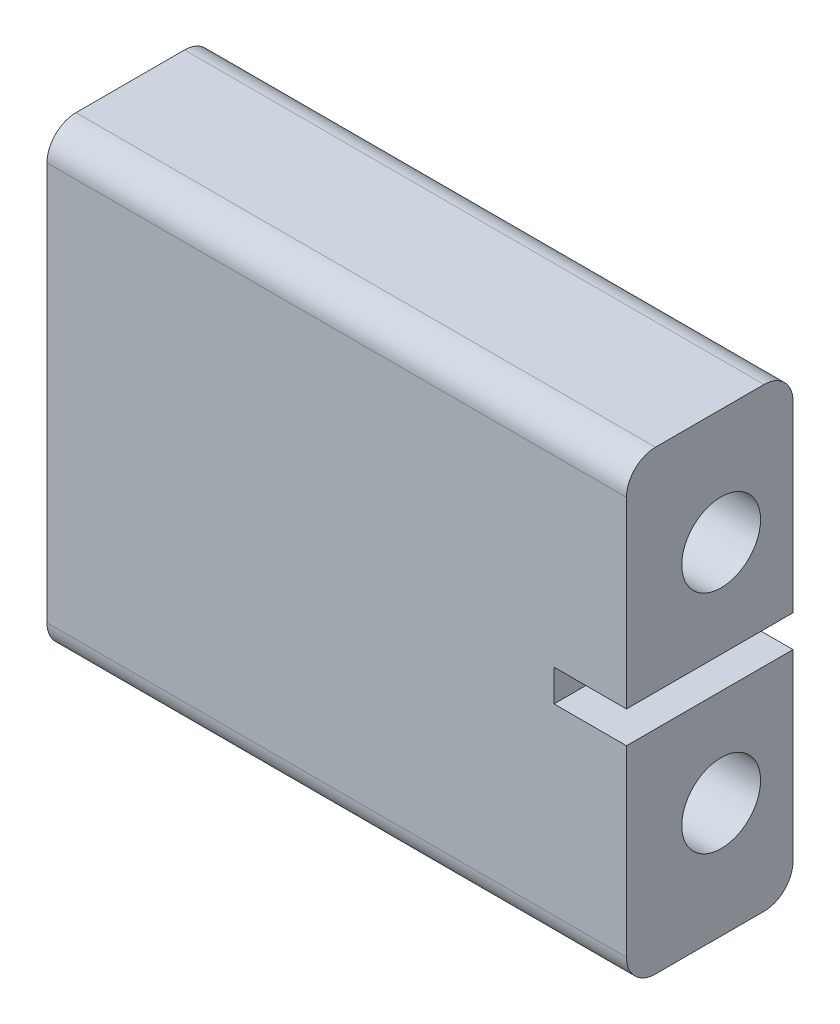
ISO-10303-21;
HEADER;
FILE_DESCRIPTION(('STEP AP214'),'2;1');
FILE_NAME('part.step','',(''),(''),'','','');
FILE_SCHEMA(('AUTOMOTIVE_DESIGN { 1 0 10303 214 1 1 1 1 }'));
ENDSEC;
DATA;
#1=APPLICATION_CONTEXT('core data for automotive mechanical design processes');
#2=APPLICATION_PROTOCOL_DEFINITION('international standard','automotive_design',2000,#1);
#3=PRODUCT_CONTEXT('',#1,'mechanical');
#4=PRODUCT('Part','Part','',(#3));
#5=PRODUCT_RELATED_PRODUCT_CATEGORY('part','',(#4));
#6=PRODUCT_DEFINITION_FORMATION('','',#4);
#7=PRODUCT_DEFINITION_CONTEXT('part definition',#1,'design');
#8=PRODUCT_DEFINITION('design','',#6,#7);
#9=PRODUCT_DEFINITION_SHAPE('','',#8);
#10=(LENGTH_UNIT() NAMED_UNIT(*) SI_UNIT(.MILLI.,.METRE.));
#11=(NAMED_UNIT(*) PLANE_ANGLE_UNIT() SI_UNIT($,.RADIAN.));
#12=(NAMED_UNIT(*) SI_UNIT($,.STERADIAN.) SOLID_ANGLE_UNIT());
#13=UNCERTAINTY_MEASURE_WITH_UNIT(LENGTH_MEASURE(1.E-05),#10,'distance_accuracy_value','');
#14=(GEOMETRIC_REPRESENTATION_CONTEXT(3) GLOBAL_UNCERTAINTY_ASSIGNED_CONTEXT((#13)) GLOBAL_UNIT_ASSIGNED_CONTEXT((#10,
#11,#12)) REPRESENTATION_CONTEXT('',''));
#15=CARTESIAN_POINT('',(0.,0.,0.));
#16=DIRECTION('',(0.,0.,1.));
#17=DIRECTION('',(1.,0.,0.));
#18=AXIS2_PLACEMENT_3D('',#15,#16,#17);
#19=CARTESIAN_POINT('',(25.4,0.,0.));
#20=DIRECTION('',(-1.,0.,0.));
#21=DIRECTION('',(0.,0.,1.));
#22=AXIS2_PLACEMENT_3D('',#19,#20,#21);
#23=PLANE('',#22);
#24=CARTESIAN_POINT('',(25.4,16.5889967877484,-23.594));
#25=DIRECTION('',(1.,0.,0.));
#26=DIRECTION('',(0.,0.,-1.));
#27=AXIS2_PLACEMENT_3D('',#24,#25,#26);
#28=CIRCLE('',#27,1.7272);
#29=CARTESIAN_POINT('',(25.4,16.5889967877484,-25.3212));
#30=VERTEX_POINT('',#29);
#31=EDGE_CURVE('E166',#30,#30,#28,.T.);
#32=ORIENTED_EDGE('',*,*,#31,.F.);
#33=EDGE_LOOP('',(#32));
#34=FACE_BOUND('',#33,.T.);
#35=DIRECTION('',(0.,1.,0.));
#36=VECTOR('',#35,1.);
#37=CARTESIAN_POINT('',(25.4,21.6389942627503,-26.744));
#38=LINE('',#37,#36);
#39=CARTESIAN_POINT('',(25.4,12.3374992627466,-26.744));
#40=VERTEX_POINT('',#39);
#41=CARTESIAN_POINT('',(25.4,20.3689942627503,-26.744));
#42=VERTEX_POINT('',#41);
#43=EDGE_CURVE('E175',#40,#42,#38,.T.);
#44=ORIENTED_EDGE('',*,*,#43,.T.);
#45=CARTESIAN_POINT('',(25.4,20.3689942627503,-25.474));
#46=DIRECTION('',(-1.,0.,0.));
#47=DIRECTION('',(0.,0.,1.));
#48=AXIS2_PLACEMENT_3D('',#45,#46,#47);
#49=CIRCLE('',#48,1.27);
#50=CARTESIAN_POINT('',(25.4,21.6389942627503,-25.474));
#51=VERTEX_POINT('',#50);
#52=EDGE_CURVE('E11',#42,#51,#49,.F.);
#53=ORIENTED_EDGE('',*,*,#52,.T.);
#54=DIRECTION('',(0.,0.,1.));
#55=VECTOR('',#54,1.);
#56=CARTESIAN_POINT('',(25.4,21.6389942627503,-19.444));
#57=LINE('',#56,#55);
#58=CARTESIAN_POINT('',(25.4,21.6389942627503,-20.714));
#59=VERTEX_POINT('',#58);
#60=EDGE_CURVE('E174',#51,#59,#57,.T.);
#61=ORIENTED_EDGE('',*,*,#60,.T.);
#62=CARTESIAN_POINT('',(25.4,20.3689942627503,-20.714));
#63=DIRECTION('',(-1.,0.,0.));
#64=DIRECTION('',(0.,0.,1.));
#65=AXIS2_PLACEMENT_3D('',#62,#63,#64);
#66=CIRCLE('',#65,1.27);
#67=CARTESIAN_POINT('',(25.4,20.3689942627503,-19.444));
#68=VERTEX_POINT('',#67);
#69=EDGE_CURVE('E44',#59,#68,#66,.F.);
#70=ORIENTED_EDGE('',*,*,#69,.T.);
#71=DIRECTION('',(0.,-1.,0.));
#72=VECTOR('',#71,1.);
#73=CARTESIAN_POINT('',(25.4,21.6389942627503,-19.444));
#74=LINE('',#73,#72);
#75=CARTESIAN_POINT('',(25.4,12.3374992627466,-19.444));
#76=VERTEX_POINT('',#75);
#77=EDGE_CURVE('E177',#68,#76,#74,.T.);
#78=ORIENTED_EDGE('',*,*,#77,.T.);
#79=DIRECTION('',(0.,0.,1.));
#80=VECTOR('',#79,1.);
#81=CARTESIAN_POINT('',(25.4,12.3374992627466,-19.444));
#82=LINE('',#81,#80);
#83=EDGE_CURVE('E145',#40,#76,#82,.T.);
#84=ORIENTED_EDGE('',*,*,#83,.F.);
#85=EDGE_LOOP('',(#44,#53,#61,#70,#78,#84));
#86=FACE_BOUND('',#85,.T.);
#87=ADVANCED_FACE('F36',(#34,#86),#23,.F.);
#88=DIRECTION('',(0.,0.,-1.));
#89=VECTOR('',#88,1.);
#90=CARTESIAN_POINT('',(25.4,1.63900426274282,-26.744));
#91=LINE('',#90,#89);
#92=CARTESIAN_POINT('',(25.4,1.63900426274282,-20.714));
#93=VERTEX_POINT('',#92);
#94=CARTESIAN_POINT('',(25.4,1.63900426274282,-25.474));
#95=VERTEX_POINT('',#94);
#96=EDGE_CURVE('E179',#93,#95,#91,.T.);
#97=ORIENTED_EDGE('',*,*,#96,.T.);
#98=CARTESIAN_POINT('',(25.4,2.90900426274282,-25.474));
#99=DIRECTION('',(-1.,0.,0.));
#100=DIRECTION('',(0.,0.,1.));
#101=AXIS2_PLACEMENT_3D('',#98,#99,#100);
#102=CIRCLE('',#101,1.27);
#103=CARTESIAN_POINT('',(25.4,2.90900426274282,-26.744));
#104=VERTEX_POINT('',#103);
#105=EDGE_CURVE('E211',#95,#104,#102,.F.);
#106=ORIENTED_EDGE('',*,*,#105,.T.);
#107=CARTESIAN_POINT('',(25.4,10.9404992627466,-26.744));
#108=VERTEX_POINT('',#107);
#109=EDGE_CURVE('E172',#104,#108,#38,.T.);
#110=ORIENTED_EDGE('',*,*,#109,.T.);
#111=DIRECTION('',(0.,0.,-1.));
#112=VECTOR('',#111,1.);
#113=CARTESIAN_POINT('',(25.4,10.9404992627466,-26.744));
#114=LINE('',#113,#112);
#115=CARTESIAN_POINT('',(25.4,10.9404992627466,-19.444));
#116=VERTEX_POINT('',#115);
#117=EDGE_CURVE('E259',#116,#108,#114,.T.);
#118=ORIENTED_EDGE('',*,*,#117,.F.);
#119=CARTESIAN_POINT('',(25.4,2.90900426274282,-19.444));
#120=VERTEX_POINT('',#119);
#121=EDGE_CURVE('E151',#116,#120,#74,.T.);
#122=ORIENTED_EDGE('',*,*,#121,.T.);
#123=CARTESIAN_POINT('',(25.4,2.90900426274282,-20.714));
#124=DIRECTION('',(-1.,0.,0.));
#125=DIRECTION('',(0.,0.,1.));
#126=AXIS2_PLACEMENT_3D('',#123,#124,#125);
#127=CIRCLE('',#126,1.27);
#128=EDGE_CURVE('E209',#120,#93,#127,.F.);
#129=ORIENTED_EDGE('',*,*,#128,.T.);
#130=EDGE_LOOP('',(#97,#106,#110,#118,#122,#129));
#131=FACE_BOUND('',#130,.T.);
#132=CARTESIAN_POINT('',(25.4,6.68900173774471,-23.594));
#133=DIRECTION('',(1.,0.,0.));
#134=DIRECTION('',(0.,0.,-1.));
#135=AXIS2_PLACEMENT_3D('',#132,#133,#134);
#136=CIRCLE('',#135,1.7272);
#137=CARTESIAN_POINT('',(25.4,6.68900173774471,-25.3212));
#138=VERTEX_POINT('',#137);
#139=EDGE_CURVE('E158',#138,#138,#136,.T.);
#140=ORIENTED_EDGE('',*,*,#139,.F.);
#141=EDGE_LOOP('',(#140));
#142=FACE_BOUND('',#141,.T.);
#143=ADVANCED_FACE('F257',(#131,#142),#23,.F.);
#144=CARTESIAN_POINT('',(0.,0.,0.));
#145=DIRECTION('',(-1.,0.,0.));
#146=DIRECTION('',(0.,0.,1.));
#147=AXIS2_PLACEMENT_3D('',#144,#145,#146);
#148=PLANE('',#147);
#149=CARTESIAN_POINT('',(0.,16.5889967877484,-23.594));
#150=DIRECTION('',(1.,0.,0.));
#151=DIRECTION('',(0.,0.,-1.));
#152=AXIS2_PLACEMENT_3D('',#149,#150,#151);
#153=CIRCLE('',#152,1.7272);
#154=CARTESIAN_POINT('',(0.,16.5889967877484,-25.3212));
#155=VERTEX_POINT('',#154);
#156=EDGE_CURVE('E161',#155,#155,#153,.T.);
#157=ORIENTED_EDGE('',*,*,#156,.T.);
#158=EDGE_LOOP('',(#157));
#159=FACE_BOUND('',#158,.T.);
#160=DIRECTION('',(0.,1.,0.));
#161=VECTOR('',#160,1.);
#162=CARTESIAN_POINT('',(0.,21.6389942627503,-26.744));
#163=LINE('',#162,#161);
#164=CARTESIAN_POINT('',(0.,2.90900426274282,-26.744));
#165=VERTEX_POINT('',#164);
#166=CARTESIAN_POINT('',(0.,20.3689942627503,-26.744));
#167=VERTEX_POINT('',#166);
#168=EDGE_CURVE('E169',#165,#167,#163,.T.);
#169=ORIENTED_EDGE('',*,*,#168,.F.);
#170=CARTESIAN_POINT('',(0.,2.90900426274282,-25.474));
#171=DIRECTION('',(-1.,0.,0.));
#172=DIRECTION('',(0.,0.,1.));
#173=AXIS2_PLACEMENT_3D('',#170,#171,#172);
#174=CIRCLE('',#173,1.27);
#175=CARTESIAN_POINT('',(0.,1.63900426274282,-25.474));
#176=VERTEX_POINT('',#175);
#177=EDGE_CURVE('E202',#165,#176,#174,.T.);
#178=ORIENTED_EDGE('',*,*,#177,.T.);
#179=DIRECTION('',(0.,0.,-1.));
#180=VECTOR('',#179,1.);
#181=CARTESIAN_POINT('',(0.,1.63900426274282,-26.744));
#182=LINE('',#181,#180);
#183=CARTESIAN_POINT('',(0.,1.63900426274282,-20.714));
#184=VERTEX_POINT('',#183);
#185=EDGE_CURVE('E189',#184,#176,#182,.T.);
#186=ORIENTED_EDGE('',*,*,#185,.F.);
#187=CARTESIAN_POINT('',(0.,2.90900426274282,-20.714));
#188=DIRECTION('',(-1.,0.,0.));
#189=DIRECTION('',(0.,0.,1.));
#190=AXIS2_PLACEMENT_3D('',#187,#188,#189);
#191=CIRCLE('',#190,1.27);
#192=CARTESIAN_POINT('',(0.,2.90900426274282,-19.444));
#193=VERTEX_POINT('',#192);
#194=EDGE_CURVE('E200',#184,#193,#191,.T.);
#195=ORIENTED_EDGE('',*,*,#194,.T.);
#196=DIRECTION('',(0.,-1.,0.));
#197=VECTOR('',#196,1.);
#198=CARTESIAN_POINT('',(0.,21.6389942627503,-19.444));
#199=LINE('',#198,#197);
#200=CARTESIAN_POINT('',(0.,20.3689942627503,-19.444));
#201=VERTEX_POINT('',#200);
#202=EDGE_CURVE('E187',#201,#193,#199,.T.);
#203=ORIENTED_EDGE('',*,*,#202,.F.);
#204=CARTESIAN_POINT('',(0.,20.3689942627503,-20.714));
#205=DIRECTION('',(-1.,0.,0.));
#206=DIRECTION('',(0.,0.,1.));
#207=AXIS2_PLACEMENT_3D('',#204,#205,#206);
#208=CIRCLE('',#207,1.27);
#209=CARTESIAN_POINT('',(0.,21.6389942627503,-20.714));
#210=VERTEX_POINT('',#209);
#211=EDGE_CURVE('E196',#201,#210,#208,.T.);
#212=ORIENTED_EDGE('',*,*,#211,.T.);
#213=DIRECTION('',(0.,0.,1.));
#214=VECTOR('',#213,1.);
#215=CARTESIAN_POINT('',(0.,21.6389942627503,-19.444));
#216=LINE('',#215,#214);
#217=CARTESIAN_POINT('',(0.,21.6389942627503,-25.474));
#218=VERTEX_POINT('',#217);
#219=EDGE_CURVE('E185',#218,#210,#216,.T.);
#220=ORIENTED_EDGE('',*,*,#219,.F.);
#221=CARTESIAN_POINT('',(0.,20.3689942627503,-25.474));
#222=DIRECTION('',(-1.,0.,0.));
#223=DIRECTION('',(0.,0.,1.));
#224=AXIS2_PLACEMENT_3D('',#221,#222,#223);
#225=CIRCLE('',#224,1.27);
#226=EDGE_CURVE('E198',#218,#167,#225,.T.);
#227=ORIENTED_EDGE('',*,*,#226,.T.);
#228=EDGE_LOOP('',(#169,#178,#186,#195,#203,#212,#220,#227));
#229=FACE_BOUND('',#228,.T.);
#230=CARTESIAN_POINT('',(0.,6.68900173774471,-23.594));
#231=DIRECTION('',(1.,0.,0.));
#232=DIRECTION('',(0.,0.,-1.));
#233=AXIS2_PLACEMENT_3D('',#230,#231,#232);
#234=CIRCLE('',#233,1.7272);
#235=CARTESIAN_POINT('',(0.,6.68900173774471,-25.3212));
#236=VERTEX_POINT('',#235);
#237=EDGE_CURVE('E162',#236,#236,#234,.T.);
#238=ORIENTED_EDGE('',*,*,#237,.T.);
#239=EDGE_LOOP('',(#238));
#240=FACE_BOUND('',#239,.T.);
#241=ADVANCED_FACE('F231',(#159,#229,#240),#148,.T.);
#242=CARTESIAN_POINT('',(25.4,21.6389942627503,-26.744));
#243=DIRECTION('',(0.,0.,1.));
#244=DIRECTION('',(1.,0.,0.));
#245=AXIS2_PLACEMENT_3D('',#242,#243,#244);
#246=PLANE('',#245);
#247=ORIENTED_EDGE('',*,*,#109,.F.);
#248=DIRECTION('',(-1.,0.,0.));
#249=VECTOR('',#248,1.);
#250=CARTESIAN_POINT('',(25.4,2.90900426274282,-26.744));
#251=LINE('',#250,#249);
#252=EDGE_CURVE('E193',#104,#165,#251,.T.);
#253=ORIENTED_EDGE('',*,*,#252,.T.);
#254=ORIENTED_EDGE('',*,*,#168,.T.);
#255=DIRECTION('',(-1.,0.,0.));
#256=VECTOR('',#255,1.);
#257=CARTESIAN_POINT('',(25.4,20.3689942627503,-26.744));
#258=LINE('',#257,#256);
#259=EDGE_CURVE('E182',#167,#42,#258,.F.);
#260=ORIENTED_EDGE('',*,*,#259,.T.);
#261=ORIENTED_EDGE('',*,*,#43,.F.);
#262=DIRECTION('',(1.,0.,0.));
#263=VECTOR('',#262,1.);
#264=CARTESIAN_POINT('',(22.225,12.3374992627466,-26.744));
#265=LINE('',#264,#263);
#266=CARTESIAN_POINT('',(22.225,12.3374992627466,-26.744));
#267=VERTEX_POINT('',#266);
#268=EDGE_CURVE('E153',#267,#40,#265,.T.);
#269=ORIENTED_EDGE('',*,*,#268,.F.);
#270=DIRECTION('',(0.,1.,0.));
#271=VECTOR('',#270,1.);
#272=CARTESIAN_POINT('',(22.225,12.3374992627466,-26.744));
#273=LINE('',#272,#271);
#274=CARTESIAN_POINT('',(22.225,10.9404992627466,-26.744));
#275=VERTEX_POINT('',#274);
#276=EDGE_CURVE('E135',#275,#267,#273,.T.);
#277=ORIENTED_EDGE('',*,*,#276,.F.);
#278=DIRECTION('',(1.,0.,0.));
#279=VECTOR('',#278,1.);
#280=CARTESIAN_POINT('',(22.225,10.9404992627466,-26.744));
#281=LINE('',#280,#279);
#282=EDGE_CURVE('E132',#275,#108,#281,.T.);
#283=ORIENTED_EDGE('',*,*,#282,.T.);
#284=EDGE_LOOP('',(#247,#253,#254,#260,#261,#269,#277,#283));
#285=FACE_BOUND('',#284,.T.);
#286=ADVANCED_FACE('F240',(#285),#246,.F.);
#287=CARTESIAN_POINT('',(25.4,21.6389942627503,-19.444));
#288=DIRECTION('',(0.,-1.,0.));
#289=DIRECTION('',(0.,0.,-1.));
#290=AXIS2_PLACEMENT_3D('',#287,#288,#289);
#291=PLANE('',#290);
#292=ORIENTED_EDGE('',*,*,#60,.F.);
#293=DIRECTION('',(-1.,0.,0.));
#294=VECTOR('',#293,1.);
#295=CARTESIAN_POINT('',(25.4,21.6389942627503,-25.474));
#296=LINE('',#295,#294);
#297=EDGE_CURVE('E219',#51,#218,#296,.T.);
#298=ORIENTED_EDGE('',*,*,#297,.T.);
#299=ORIENTED_EDGE('',*,*,#219,.T.);
#300=DIRECTION('',(-1.,0.,0.));
#301=VECTOR('',#300,1.);
#302=CARTESIAN_POINT('',(25.4,21.6389942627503,-20.714));
#303=LINE('',#302,#301);
#304=EDGE_CURVE('E51',#210,#59,#303,.F.);
#305=ORIENTED_EDGE('',*,*,#304,.T.);
#306=EDGE_LOOP('',(#292,#298,#299,#305));
#307=FACE_BOUND('',#306,.T.);
#308=ADVANCED_FACE('F233',(#307),#291,.F.);
#309=CARTESIAN_POINT('',(25.4,21.6389942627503,-19.444));
#310=DIRECTION('',(0.,0.,-1.));
#311=DIRECTION('',(-1.,0.,0.));
#312=AXIS2_PLACEMENT_3D('',#309,#310,#311);
#313=PLANE('',#312);
#314=ORIENTED_EDGE('',*,*,#202,.T.);
#315=DIRECTION('',(-1.,0.,0.));
#316=VECTOR('',#315,1.);
#317=CARTESIAN_POINT('',(25.4,2.90900426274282,-19.444));
#318=LINE('',#317,#316);
#319=EDGE_CURVE('E216',#193,#120,#318,.F.);
#320=ORIENTED_EDGE('',*,*,#319,.T.);
#321=ORIENTED_EDGE('',*,*,#121,.F.);
#322=DIRECTION('',(1.,0.,0.));
#323=VECTOR('',#322,1.);
#324=CARTESIAN_POINT('',(22.225,10.9404992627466,-19.444));
#325=LINE('',#324,#323);
#326=CARTESIAN_POINT('',(22.225,10.9404992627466,-19.444));
#327=VERTEX_POINT('',#326);
#328=EDGE_CURVE('E129',#327,#116,#325,.T.);
#329=ORIENTED_EDGE('',*,*,#328,.F.);
#330=DIRECTION('',(0.,-1.,0.));
#331=VECTOR('',#330,1.);
#332=CARTESIAN_POINT('',(22.225,10.9404992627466,-19.444));
#333=LINE('',#332,#331);
#334=CARTESIAN_POINT('',(22.225,12.3374992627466,-19.444));
#335=VERTEX_POINT('',#334);
#336=EDGE_CURVE('E136',#335,#327,#333,.T.);
#337=ORIENTED_EDGE('',*,*,#336,.F.);
#338=DIRECTION('',(1.,0.,0.));
#339=VECTOR('',#338,1.);
#340=CARTESIAN_POINT('',(22.225,12.3374992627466,-19.444));
#341=LINE('',#340,#339);
#342=EDGE_CURVE('E165',#335,#76,#341,.T.);
#343=ORIENTED_EDGE('',*,*,#342,.T.);
#344=ORIENTED_EDGE('',*,*,#77,.F.);
#345=DIRECTION('',(-1.,0.,0.));
#346=VECTOR('',#345,1.);
#347=CARTESIAN_POINT('',(25.4,20.3689942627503,-19.444));
#348=LINE('',#347,#346);
#349=EDGE_CURVE('E213',#68,#201,#348,.T.);
#350=ORIENTED_EDGE('',*,*,#349,.T.);
#351=EDGE_LOOP('',(#314,#320,#321,#329,#337,#343,#344,#350));
#352=FACE_BOUND('',#351,.T.);
#353=ADVANCED_FACE('F149',(#352),#313,.F.);
#354=CARTESIAN_POINT('',(25.4,1.63900426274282,-26.744));
#355=DIRECTION('',(0.,1.,0.));
#356=DIRECTION('',(0.,0.,1.));
#357=AXIS2_PLACEMENT_3D('',#354,#355,#356);
#358=PLANE('',#357);
#359=ORIENTED_EDGE('',*,*,#185,.T.);
#360=DIRECTION('',(-1.,0.,0.));
#361=VECTOR('',#360,1.);
#362=CARTESIAN_POINT('',(25.4,1.63900426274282,-25.474));
#363=LINE('',#362,#361);
#364=EDGE_CURVE('E207',#176,#95,#363,.F.);
#365=ORIENTED_EDGE('',*,*,#364,.T.);
#366=ORIENTED_EDGE('',*,*,#96,.F.);
#367=DIRECTION('',(-1.,0.,0.));
#368=VECTOR('',#367,1.);
#369=CARTESIAN_POINT('',(25.4,1.63900426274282,-20.714));
#370=LINE('',#369,#368);
#371=EDGE_CURVE('E204',#93,#184,#370,.T.);
#372=ORIENTED_EDGE('',*,*,#371,.T.);
#373=EDGE_LOOP('',(#359,#365,#366,#372));
#374=FACE_BOUND('',#373,.T.);
#375=ADVANCED_FACE('F249',(#374),#358,.F.);
#376=CARTESIAN_POINT('',(25.4,16.5889967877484,-23.594));
#377=DIRECTION('',(-1.,0.,0.));
#378=DIRECTION('',(0.,0.,1.));
#379=AXIS2_PLACEMENT_3D('',#376,#377,#378);
#380=CYLINDRICAL_SURFACE('',#379,1.7272);
#381=ORIENTED_EDGE('',*,*,#31,.T.);
#382=EDGE_LOOP('',(#381));
#383=FACE_BOUND('',#382,.T.);
#384=ORIENTED_EDGE('',*,*,#156,.F.);
#385=EDGE_LOOP('',(#384));
#386=FACE_BOUND('',#385,.T.);
#387=ADVANCED_FACE('F275',(#383,#386),#380,.F.);
#388=CARTESIAN_POINT('',(25.4,6.68900173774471,-23.594));
#389=DIRECTION('',(-1.,0.,0.));
#390=DIRECTION('',(0.,0.,1.));
#391=AXIS2_PLACEMENT_3D('',#388,#389,#390);
#392=CYLINDRICAL_SURFACE('',#391,1.7272);
#393=ORIENTED_EDGE('',*,*,#139,.T.);
#394=EDGE_LOOP('',(#393));
#395=FACE_BOUND('',#394,.T.);
#396=ORIENTED_EDGE('',*,*,#237,.F.);
#397=EDGE_LOOP('',(#396));
#398=FACE_BOUND('',#397,.T.);
#399=ADVANCED_FACE('F268',(#395,#398),#392,.F.);
#400=CARTESIAN_POINT('',(22.225,12.3374992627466,-19.444));
#401=DIRECTION('',(0.,1.,0.));
#402=DIRECTION('',(0.,0.,1.));
#403=AXIS2_PLACEMENT_3D('',#400,#401,#402);
#404=PLANE('',#403);
#405=ORIENTED_EDGE('',*,*,#83,.T.);
#406=ORIENTED_EDGE('',*,*,#342,.F.);
#407=DIRECTION('',(0.,0.,1.));
#408=VECTOR('',#407,1.);
#409=CARTESIAN_POINT('',(22.225,12.3374992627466,-19.444));
#410=LINE('',#409,#408);
#411=EDGE_CURVE('E141',#267,#335,#410,.T.);
#412=ORIENTED_EDGE('',*,*,#411,.F.);
#413=ORIENTED_EDGE('',*,*,#268,.T.);
#414=EDGE_LOOP('',(#405,#406,#412,#413));
#415=FACE_BOUND('',#414,.T.);
#416=ADVANCED_FACE('F266',(#415),#404,.F.);
#417=CARTESIAN_POINT('',(22.225,10.9404992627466,-26.744));
#418=DIRECTION('',(0.,-1.,0.));
#419=DIRECTION('',(0.,0.,-1.));
#420=AXIS2_PLACEMENT_3D('',#417,#418,#419);
#421=PLANE('',#420);
#422=ORIENTED_EDGE('',*,*,#117,.T.);
#423=ORIENTED_EDGE('',*,*,#282,.F.);
#424=DIRECTION('',(0.,0.,-1.));
#425=VECTOR('',#424,1.);
#426=CARTESIAN_POINT('',(22.225,10.9404992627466,-26.744));
#427=LINE('',#426,#425);
#428=EDGE_CURVE('E124',#327,#275,#427,.T.);
#429=ORIENTED_EDGE('',*,*,#428,.F.);
#430=ORIENTED_EDGE('',*,*,#328,.T.);
#431=EDGE_LOOP('',(#422,#423,#429,#430));
#432=FACE_BOUND('',#431,.T.);
#433=ADVANCED_FACE('F127',(#432),#421,.F.);
#434=CARTESIAN_POINT('',(22.225,0.,0.));
#435=DIRECTION('',(-1.,0.,0.));
#436=DIRECTION('',(0.,0.,1.));
#437=AXIS2_PLACEMENT_3D('',#434,#435,#436);
#438=PLANE('',#437);
#439=ORIENTED_EDGE('',*,*,#336,.T.);
#440=ORIENTED_EDGE('',*,*,#428,.T.);
#441=ORIENTED_EDGE('',*,*,#276,.T.);
#442=ORIENTED_EDGE('',*,*,#411,.T.);
#443=EDGE_LOOP('',(#439,#440,#441,#442));
#444=FACE_BOUND('',#443,.T.);
#445=ADVANCED_FACE('F139',(#444),#438,.F.);
#446=CARTESIAN_POINT('',(25.4,2.90900426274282,-25.474));
#447=DIRECTION('',(-1.,0.,0.));
#448=DIRECTION('',(0.,0.,1.));
#449=AXIS2_PLACEMENT_3D('',#446,#447,#448);
#450=CYLINDRICAL_SURFACE('',#449,1.27);
#451=ORIENTED_EDGE('',*,*,#105,.F.);
#452=ORIENTED_EDGE('',*,*,#364,.F.);
#453=ORIENTED_EDGE('',*,*,#177,.F.);
#454=ORIENTED_EDGE('',*,*,#252,.F.);
#455=EDGE_LOOP('',(#451,#452,#453,#454));
#456=FACE_BOUND('',#455,.T.);
#457=ADVANCED_FACE('F245',(#456),#450,.T.);
#458=CARTESIAN_POINT('',(25.4,2.90900426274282,-20.714));
#459=DIRECTION('',(-1.,0.,0.));
#460=DIRECTION('',(0.,0.,1.));
#461=AXIS2_PLACEMENT_3D('',#458,#459,#460);
#462=CYLINDRICAL_SURFACE('',#461,1.27);
#463=ORIENTED_EDGE('',*,*,#128,.F.);
#464=ORIENTED_EDGE('',*,*,#319,.F.);
#465=ORIENTED_EDGE('',*,*,#194,.F.);
#466=ORIENTED_EDGE('',*,*,#371,.F.);
#467=EDGE_LOOP('',(#463,#464,#465,#466));
#468=FACE_BOUND('',#467,.T.);
#469=ADVANCED_FACE('F254',(#468),#462,.T.);
#470=CARTESIAN_POINT('',(25.4,20.3689942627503,-25.474));
#471=DIRECTION('',(-1.,0.,0.));
#472=DIRECTION('',(0.,0.,1.));
#473=AXIS2_PLACEMENT_3D('',#470,#471,#472);
#474=CYLINDRICAL_SURFACE('',#473,1.27);
#475=ORIENTED_EDGE('',*,*,#52,.F.);
#476=ORIENTED_EDGE('',*,*,#259,.F.);
#477=ORIENTED_EDGE('',*,*,#226,.F.);
#478=ORIENTED_EDGE('',*,*,#297,.F.);
#479=EDGE_LOOP('',(#475,#476,#477,#478));
#480=FACE_BOUND('',#479,.T.);
#481=ADVANCED_FACE('F236',(#480),#474,.T.);
#482=CARTESIAN_POINT('',(25.4,20.3689942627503,-20.714));
#483=DIRECTION('',(-1.,0.,0.));
#484=DIRECTION('',(0.,0.,1.));
#485=AXIS2_PLACEMENT_3D('',#482,#483,#484);
#486=CYLINDRICAL_SURFACE('',#485,1.27);
#487=ORIENTED_EDGE('',*,*,#69,.F.);
#488=ORIENTED_EDGE('',*,*,#304,.F.);
#489=ORIENTED_EDGE('',*,*,#211,.F.);
#490=ORIENTED_EDGE('',*,*,#349,.F.);
#491=EDGE_LOOP('',(#487,#488,#489,#490));
#492=FACE_BOUND('',#491,.T.);
#493=ADVANCED_FACE('F38',(#492),#486,.T.);
#494=CLOSED_SHELL('',(#87,#143,#241,#286,#308,#353,#375,#387,#399,#416,#433,#445,#457,#469,#481,#493));
#495=MANIFOLD_SOLID_BREP('B2',#494);
#496=ADVANCED_BREP_SHAPE_REPRESENTATION('',(#18,#495),#14);
#497=SHAPE_DEFINITION_REPRESENTATION(#9,#496);
ENDSEC;
END-ISO-10303-21;
